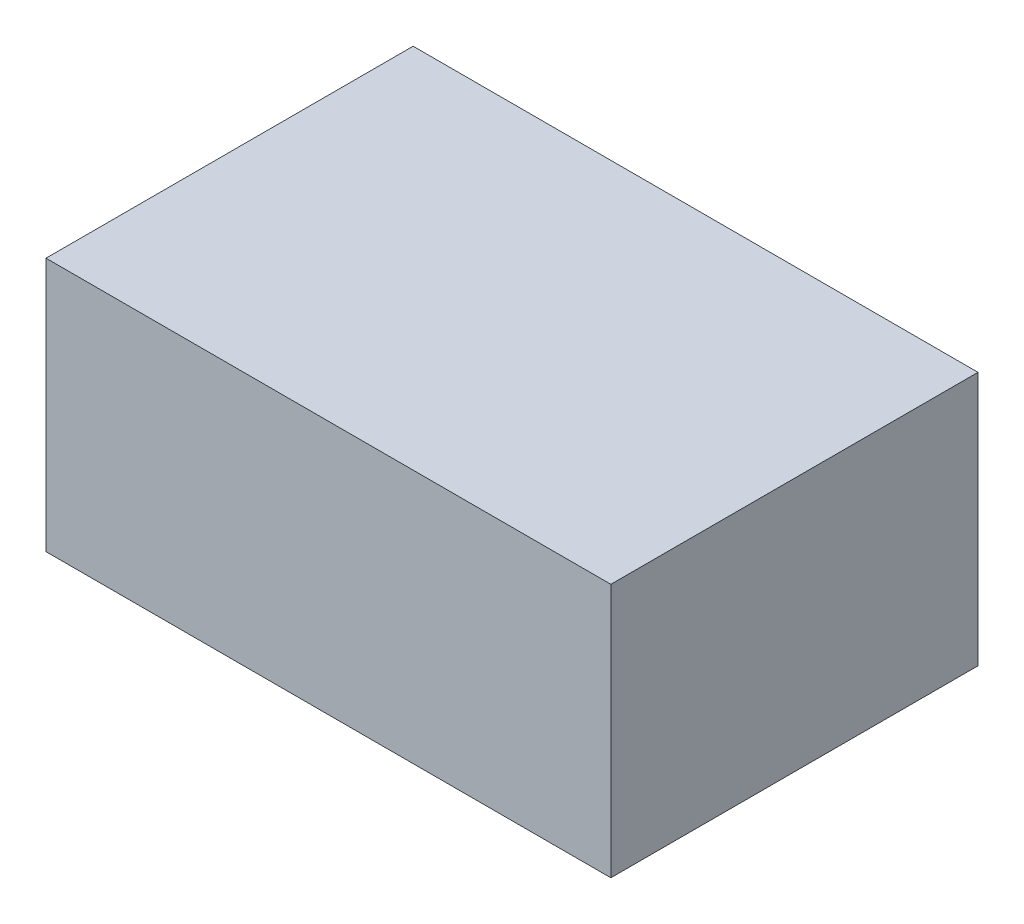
from build123d import *

# Parameters (mm, degrees)
SKETCH1_W           = 101.6
SKETCH1_H           = 66.04
BOSS_EXTRUDE1_DEPTH = 45.72


with BuildPart() as part:
    # Sketch1 → Boss-Extrude1 (new body)
    with BuildSketch(Plane(origin=(0, 0, 0), x_dir=(1, 0, 0), z_dir=(0, 1, 0))):
        with Locations((50.8, 33.02)):
            Rectangle(SKETCH1_W, SKETCH1_H)
    extrude(amount=BOSS_EXTRUDE1_DEPTH)


solid = part.part
